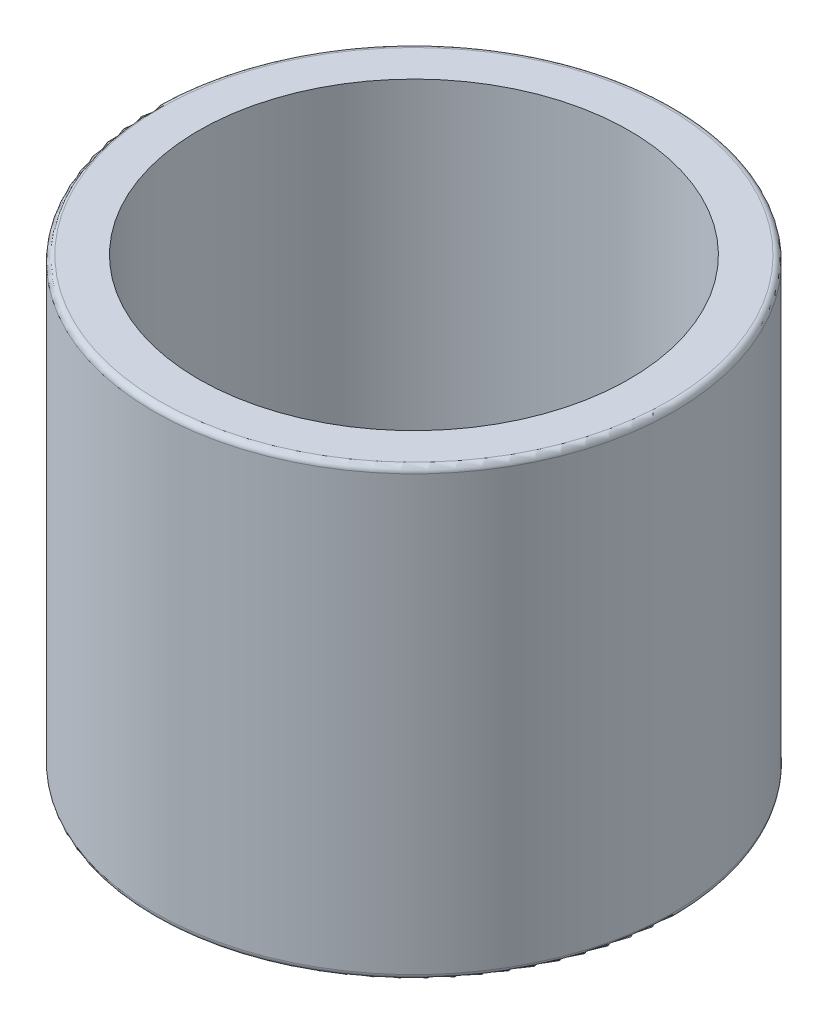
ISO-10303-21;
HEADER;
FILE_DESCRIPTION(('STEP AP214'),'2;1');
FILE_NAME('part.step','',(''),(''),'','','');
FILE_SCHEMA(('AUTOMOTIVE_DESIGN { 1 0 10303 214 1 1 1 1 }'));
ENDSEC;
DATA;
#1=APPLICATION_CONTEXT('core data for automotive mechanical design processes');
#2=APPLICATION_PROTOCOL_DEFINITION('international standard','automotive_design',2000,#1);
#3=PRODUCT_CONTEXT('',#1,'mechanical');
#4=PRODUCT('Part','Part','',(#3));
#5=PRODUCT_RELATED_PRODUCT_CATEGORY('part','',(#4));
#6=PRODUCT_DEFINITION_FORMATION('','',#4);
#7=PRODUCT_DEFINITION_CONTEXT('part definition',#1,'design');
#8=PRODUCT_DEFINITION('design','',#6,#7);
#9=PRODUCT_DEFINITION_SHAPE('','',#8);
#10=(LENGTH_UNIT() NAMED_UNIT(*) SI_UNIT(.MILLI.,.METRE.));
#11=(NAMED_UNIT(*) PLANE_ANGLE_UNIT() SI_UNIT($,.RADIAN.));
#12=(NAMED_UNIT(*) SI_UNIT($,.STERADIAN.) SOLID_ANGLE_UNIT());
#13=UNCERTAINTY_MEASURE_WITH_UNIT(LENGTH_MEASURE(1.E-05),#10,'distance_accuracy_value','');
#14=(GEOMETRIC_REPRESENTATION_CONTEXT(3) GLOBAL_UNCERTAINTY_ASSIGNED_CONTEXT((#13)) GLOBAL_UNIT_ASSIGNED_CONTEXT((#10,
#11,#12)) REPRESENTATION_CONTEXT('',''));
#15=CARTESIAN_POINT('',(0.,0.,0.));
#16=DIRECTION('',(0.,0.,1.));
#17=DIRECTION('',(1.,0.,0.));
#18=AXIS2_PLACEMENT_3D('',#15,#16,#17);
#19=CARTESIAN_POINT('',(0.,30.,0.));
#20=DIRECTION('',(0.,1.,0.));
#21=DIRECTION('',(0.,0.,1.));
#22=AXIS2_PLACEMENT_3D('',#19,#20,#21);
#23=PLANE('',#22);
#24=CARTESIAN_POINT('',(0.,30.,0.));
#25=DIRECTION('',(0.,1.,0.));
#26=DIRECTION('',(0.,0.,1.));
#27=AXIS2_PLACEMENT_3D('',#24,#25,#26);
#28=CIRCLE('',#27,17.1);
#29=CARTESIAN_POINT('',(0.,30.,17.1));
#30=VERTEX_POINT('',#29);
#31=EDGE_CURVE('E10',#30,#30,#28,.T.);
#32=ORIENTED_EDGE('',*,*,#31,.T.);
#33=EDGE_LOOP('',(#32));
#34=FACE_BOUND('',#33,.T.);
#35=CARTESIAN_POINT('',(0.,30.,0.));
#36=DIRECTION('',(0.,1.,0.));
#37=DIRECTION('',(0.,0.,1.));
#38=AXIS2_PLACEMENT_3D('',#35,#36,#37);
#39=CIRCLE('',#38,14.5);
#40=CARTESIAN_POINT('',(0.,30.,14.5));
#41=VERTEX_POINT('',#40);
#42=EDGE_CURVE('E51',#41,#41,#39,.T.);
#43=ORIENTED_EDGE('',*,*,#42,.F.);
#44=EDGE_LOOP('',(#43));
#45=FACE_BOUND('',#44,.T.);
#46=ADVANCED_FACE('F31',(#34,#45),#23,.T.);
#47=CARTESIAN_POINT('',(0.,0.,0.));
#48=DIRECTION('',(0.,1.,0.));
#49=DIRECTION('',(0.,0.,1.));
#50=AXIS2_PLACEMENT_3D('',#47,#48,#49);
#51=PLANE('',#50);
#52=CARTESIAN_POINT('',(0.,0.,0.));
#53=DIRECTION('',(0.,1.,0.));
#54=DIRECTION('',(0.,0.,1.));
#55=AXIS2_PLACEMENT_3D('',#52,#53,#54);
#56=CIRCLE('',#55,17.1);
#57=CARTESIAN_POINT('',(0.,0.,17.1));
#58=VERTEX_POINT('',#57);
#59=EDGE_CURVE('E38',#58,#58,#56,.F.);
#60=ORIENTED_EDGE('',*,*,#59,.T.);
#61=EDGE_LOOP('',(#60));
#62=FACE_BOUND('',#61,.T.);
#63=CARTESIAN_POINT('',(0.,0.,0.));
#64=DIRECTION('',(0.,1.,0.));
#65=DIRECTION('',(0.,0.,1.));
#66=AXIS2_PLACEMENT_3D('',#63,#64,#65);
#67=CIRCLE('',#66,14.5);
#68=CARTESIAN_POINT('',(0.,0.,14.5));
#69=VERTEX_POINT('',#68);
#70=EDGE_CURVE('E52',#69,#69,#67,.T.);
#71=ORIENTED_EDGE('',*,*,#70,.T.);
#72=EDGE_LOOP('',(#71));
#73=FACE_BOUND('',#72,.T.);
#74=ADVANCED_FACE('F62',(#62,#73),#51,.F.);
#75=CARTESIAN_POINT('',(0.,30.,0.));
#76=DIRECTION('',(0.,-1.,0.));
#77=DIRECTION('',(0.,0.,-1.));
#78=AXIS2_PLACEMENT_3D('',#75,#76,#77);
#79=CYLINDRICAL_SURFACE('',#78,17.5);
#80=CARTESIAN_POINT('',(0.,0.400000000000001,0.));
#81=DIRECTION('',(0.,1.,0.));
#82=DIRECTION('',(0.,0.,1.));
#83=AXIS2_PLACEMENT_3D('',#80,#81,#82);
#84=CIRCLE('',#83,17.5);
#85=CARTESIAN_POINT('',(0.,0.400000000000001,17.5));
#86=VERTEX_POINT('',#85);
#87=EDGE_CURVE('E42',#86,#86,#84,.T.);
#88=ORIENTED_EDGE('',*,*,#87,.T.);
#89=EDGE_LOOP('',(#88));
#90=FACE_BOUND('',#89,.T.);
#91=CARTESIAN_POINT('',(0.,29.6,0.));
#92=DIRECTION('',(0.,1.,0.));
#93=DIRECTION('',(0.,0.,1.));
#94=AXIS2_PLACEMENT_3D('',#91,#92,#93);
#95=CIRCLE('',#94,17.5);
#96=CARTESIAN_POINT('',(0.,29.6,17.5));
#97=VERTEX_POINT('',#96);
#98=EDGE_CURVE('E46',#97,#97,#95,.F.);
#99=ORIENTED_EDGE('',*,*,#98,.T.);
#100=EDGE_LOOP('',(#99));
#101=FACE_BOUND('',#100,.T.);
#102=ADVANCED_FACE('F67',(#90,#101),#79,.T.);
#103=CARTESIAN_POINT('',(0.,30.,0.));
#104=DIRECTION('',(0.,-1.,0.));
#105=DIRECTION('',(0.,0.,-1.));
#106=AXIS2_PLACEMENT_3D('',#103,#104,#105);
#107=CYLINDRICAL_SURFACE('',#106,14.5);
#108=ORIENTED_EDGE('',*,*,#42,.T.);
#109=EDGE_LOOP('',(#108));
#110=FACE_BOUND('',#109,.T.);
#111=ORIENTED_EDGE('',*,*,#70,.F.);
#112=EDGE_LOOP('',(#111));
#113=FACE_BOUND('',#112,.T.);
#114=ADVANCED_FACE('F58',(#110,#113),#107,.F.);
#115=CARTESIAN_POINT('',(0.,0.400000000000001,0.));
#116=DIRECTION('',(0.,1.,0.));
#117=DIRECTION('',(0.,0.,1.));
#118=AXIS2_PLACEMENT_3D('',#115,#116,#117);
#119=TOROIDAL_SURFACE('',#118,17.1,0.4);
#120=ORIENTED_EDGE('',*,*,#59,.F.);
#121=EDGE_LOOP('',(#120));
#122=FACE_BOUND('',#121,.T.);
#123=ORIENTED_EDGE('',*,*,#87,.F.);
#124=EDGE_LOOP('',(#123));
#125=FACE_BOUND('',#124,.T.);
#126=ADVANCED_FACE('F73',(#122,#125),#119,.T.);
#127=CARTESIAN_POINT('',(0.,29.6,0.));
#128=DIRECTION('',(0.,1.,0.));
#129=DIRECTION('',(0.,0.,1.));
#130=AXIS2_PLACEMENT_3D('',#127,#128,#129);
#131=TOROIDAL_SURFACE('',#130,17.1,0.4);
#132=ORIENTED_EDGE('',*,*,#98,.F.);
#133=EDGE_LOOP('',(#132));
#134=FACE_BOUND('',#133,.T.);
#135=ORIENTED_EDGE('',*,*,#31,.F.);
#136=EDGE_LOOP('',(#135));
#137=FACE_BOUND('',#136,.T.);
#138=ADVANCED_FACE('F33',(#134,#137),#131,.T.);
#139=CLOSED_SHELL('',(#46,#74,#102,#114,#126,#138));
#140=MANIFOLD_SOLID_BREP('B2',#139);
#141=ADVANCED_BREP_SHAPE_REPRESENTATION('',(#18,#140),#14);
#142=SHAPE_DEFINITION_REPRESENTATION(#9,#141);
ENDSEC;
END-ISO-10303-21;
